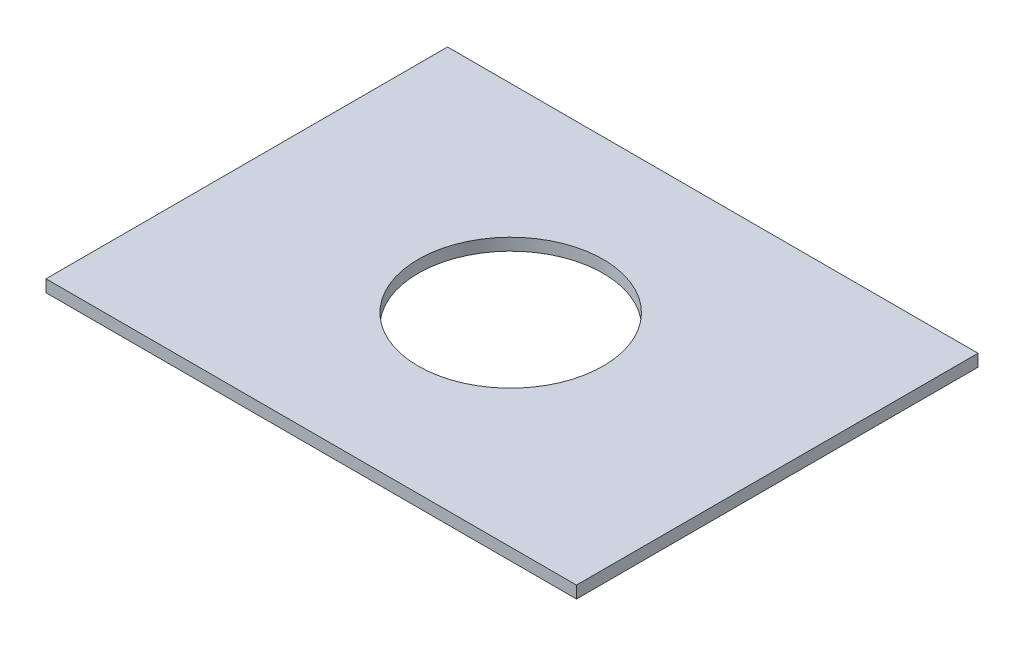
ISO-10303-21;
HEADER;
FILE_DESCRIPTION(('STEP AP214'),'2;1');
FILE_NAME('part.step','',(''),(''),'','','');
FILE_SCHEMA(('AUTOMOTIVE_DESIGN { 1 0 10303 214 1 1 1 1 }'));
ENDSEC;
DATA;
#1=APPLICATION_CONTEXT('core data for automotive mechanical design processes');
#2=APPLICATION_PROTOCOL_DEFINITION('international standard','automotive_design',2000,#1);
#3=PRODUCT_CONTEXT('',#1,'mechanical');
#4=PRODUCT('Part','Part','',(#3));
#5=PRODUCT_RELATED_PRODUCT_CATEGORY('part','',(#4));
#6=PRODUCT_DEFINITION_FORMATION('','',#4);
#7=PRODUCT_DEFINITION_CONTEXT('part definition',#1,'design');
#8=PRODUCT_DEFINITION('design','',#6,#7);
#9=PRODUCT_DEFINITION_SHAPE('','',#8);
#10=(LENGTH_UNIT() NAMED_UNIT(*) SI_UNIT(.MILLI.,.METRE.));
#11=(NAMED_UNIT(*) PLANE_ANGLE_UNIT() SI_UNIT($,.RADIAN.));
#12=(NAMED_UNIT(*) SI_UNIT($,.STERADIAN.) SOLID_ANGLE_UNIT());
#13=UNCERTAINTY_MEASURE_WITH_UNIT(LENGTH_MEASURE(1.E-05),#10,'distance_accuracy_value','');
#14=(GEOMETRIC_REPRESENTATION_CONTEXT(3) GLOBAL_UNCERTAINTY_ASSIGNED_CONTEXT((#13)) GLOBAL_UNIT_ASSIGNED_CONTEXT((#10,
#11,#12)) REPRESENTATION_CONTEXT('',''));
#15=CARTESIAN_POINT('',(0.,0.,0.));
#16=DIRECTION('',(0.,0.,1.));
#17=DIRECTION('',(1.,0.,0.));
#18=AXIS2_PLACEMENT_3D('',#15,#16,#17);
#19=CARTESIAN_POINT('',(0.,2.54,0.));
#20=DIRECTION('',(1.,0.,0.));
#21=DIRECTION('',(0.,0.,-1.));
#22=AXIS2_PLACEMENT_3D('',#19,#20,#21);
#23=PLANE('',#22);
#24=DIRECTION('',(0.,0.,1.));
#25=VECTOR('',#24,1.);
#26=CARTESIAN_POINT('',(0.,0.,0.));
#27=LINE('',#26,#25);
#28=CARTESIAN_POINT('',(0.,0.,-84.2861057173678));
#29=VERTEX_POINT('',#28);
#30=CARTESIAN_POINT('',(0.,0.,0.));
#31=VERTEX_POINT('',#30);
#32=EDGE_CURVE('E80',#29,#31,#27,.T.);
#33=ORIENTED_EDGE('',*,*,#32,.T.);
#34=DIRECTION('',(0.,-1.,0.));
#35=VECTOR('',#34,1.);
#36=CARTESIAN_POINT('',(0.,2.54,0.));
#37=LINE('',#36,#35);
#38=CARTESIAN_POINT('',(0.,2.54,0.));
#39=VERTEX_POINT('',#38);
#40=EDGE_CURVE('E11',#39,#31,#37,.T.);
#41=ORIENTED_EDGE('',*,*,#40,.F.);
#42=DIRECTION('',(0.,0.,1.));
#43=VECTOR('',#42,1.);
#44=CARTESIAN_POINT('',(0.,2.54,0.));
#45=LINE('',#44,#43);
#46=CARTESIAN_POINT('',(0.,2.54,-84.2861057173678));
#47=VERTEX_POINT('',#46);
#48=EDGE_CURVE('E103',#47,#39,#45,.T.);
#49=ORIENTED_EDGE('',*,*,#48,.F.);
#50=DIRECTION('',(0.,-1.,0.));
#51=VECTOR('',#50,1.);
#52=CARTESIAN_POINT('',(0.,2.54,-84.2861057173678));
#53=LINE('',#52,#51);
#54=EDGE_CURVE('E92',#47,#29,#53,.T.);
#55=ORIENTED_EDGE('',*,*,#54,.T.);
#56=EDGE_LOOP('',(#33,#41,#49,#55));
#57=FACE_BOUND('',#56,.T.);
#58=ADVANCED_FACE('F36',(#57),#23,.F.);
#59=CARTESIAN_POINT('',(0.,2.54,0.));
#60=DIRECTION('',(0.,0.,-1.));
#61=DIRECTION('',(-1.,0.,0.));
#62=AXIS2_PLACEMENT_3D('',#59,#60,#61);
#63=PLANE('',#62);
#64=DIRECTION('',(1.,0.,0.));
#65=VECTOR('',#64,1.);
#66=CARTESIAN_POINT('',(0.,0.,0.));
#67=LINE('',#66,#65);
#68=CARTESIAN_POINT('',(111.357497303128,0.,0.));
#69=VERTEX_POINT('',#68);
#70=EDGE_CURVE('E76',#31,#69,#67,.T.);
#71=ORIENTED_EDGE('',*,*,#70,.T.);
#72=DIRECTION('',(0.,-1.,0.));
#73=VECTOR('',#72,1.);
#74=CARTESIAN_POINT('',(111.357497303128,2.54,0.));
#75=LINE('',#74,#73);
#76=CARTESIAN_POINT('',(111.357497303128,2.54,0.));
#77=VERTEX_POINT('',#76);
#78=EDGE_CURVE('E43',#77,#69,#75,.T.);
#79=ORIENTED_EDGE('',*,*,#78,.F.);
#80=DIRECTION('',(1.,0.,0.));
#81=VECTOR('',#80,1.);
#82=CARTESIAN_POINT('',(0.,2.54,0.));
#83=LINE('',#82,#81);
#84=EDGE_CURVE('E88',#39,#77,#83,.T.);
#85=ORIENTED_EDGE('',*,*,#84,.F.);
#86=ORIENTED_EDGE('',*,*,#40,.T.);
#87=EDGE_LOOP('',(#71,#79,#85,#86));
#88=FACE_BOUND('',#87,.T.);
#89=ADVANCED_FACE('F87',(#88),#63,.F.);
#90=CARTESIAN_POINT('',(111.357497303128,2.54,0.));
#91=DIRECTION('',(-1.,0.,0.));
#92=DIRECTION('',(0.,0.,1.));
#93=AXIS2_PLACEMENT_3D('',#90,#91,#92);
#94=PLANE('',#93);
#95=DIRECTION('',(0.,0.,-1.));
#96=VECTOR('',#95,1.);
#97=CARTESIAN_POINT('',(111.357497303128,0.,0.));
#98=LINE('',#97,#96);
#99=CARTESIAN_POINT('',(111.357497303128,0.,-84.2861057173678));
#100=VERTEX_POINT('',#99);
#101=EDGE_CURVE('E81',#69,#100,#98,.T.);
#102=ORIENTED_EDGE('',*,*,#101,.T.);
#103=DIRECTION('',(0.,-1.,0.));
#104=VECTOR('',#103,1.);
#105=CARTESIAN_POINT('',(111.357497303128,2.54,-84.2861057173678));
#106=LINE('',#105,#104);
#107=CARTESIAN_POINT('',(111.357497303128,2.54,-84.2861057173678));
#108=VERTEX_POINT('',#107);
#109=EDGE_CURVE('E109',#108,#100,#106,.T.);
#110=ORIENTED_EDGE('',*,*,#109,.F.);
#111=DIRECTION('',(0.,0.,-1.));
#112=VECTOR('',#111,1.);
#113=CARTESIAN_POINT('',(111.357497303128,2.54,0.));
#114=LINE('',#113,#112);
#115=EDGE_CURVE('E55',#77,#108,#114,.T.);
#116=ORIENTED_EDGE('',*,*,#115,.F.);
#117=ORIENTED_EDGE('',*,*,#78,.T.);
#118=EDGE_LOOP('',(#102,#110,#116,#117));
#119=FACE_BOUND('',#118,.T.);
#120=ADVANCED_FACE('F112',(#119),#94,.F.);
#121=CARTESIAN_POINT('',(0.,2.54,-84.2861057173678));
#122=DIRECTION('',(0.,0.,1.));
#123=DIRECTION('',(1.,0.,0.));
#124=AXIS2_PLACEMENT_3D('',#121,#122,#123);
#125=PLANE('',#124);
#126=DIRECTION('',(-1.,0.,0.));
#127=VECTOR('',#126,1.);
#128=CARTESIAN_POINT('',(0.,0.,-84.2861057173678));
#129=LINE('',#128,#127);
#130=EDGE_CURVE('E101',#100,#29,#129,.T.);
#131=ORIENTED_EDGE('',*,*,#130,.T.);
#132=ORIENTED_EDGE('',*,*,#54,.F.);
#133=DIRECTION('',(-1.,0.,0.));
#134=VECTOR('',#133,1.);
#135=CARTESIAN_POINT('',(0.,2.54,-84.2861057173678));
#136=LINE('',#135,#134);
#137=EDGE_CURVE('E50',#108,#47,#136,.T.);
#138=ORIENTED_EDGE('',*,*,#137,.F.);
#139=ORIENTED_EDGE('',*,*,#109,.T.);
#140=EDGE_LOOP('',(#131,#132,#138,#139));
#141=FACE_BOUND('',#140,.T.);
#142=ADVANCED_FACE('F114',(#141),#125,.F.);
#143=CARTESIAN_POINT('',(0.,2.54,-84.2861057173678));
#144=DIRECTION('',(0.,-1.,0.));
#145=DIRECTION('',(0.,0.,-1.));
#146=AXIS2_PLACEMENT_3D('',#143,#144,#145);
#147=PLANE('',#146);
#148=CARTESIAN_POINT('',(54.9361469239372,2.54,-42.6071789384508));
#149=DIRECTION('',(0.,1.,0.));
#150=DIRECTION('',(0.,0.,1.));
#151=AXIS2_PLACEMENT_3D('',#148,#149,#150);
#152=CIRCLE('',#151,19.4132473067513);
#153=CARTESIAN_POINT('',(54.9361469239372,2.54,-23.1939316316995));
#154=VERTEX_POINT('',#153);
#155=EDGE_CURVE('E96',#154,#154,#152,.T.);
#156=ORIENTED_EDGE('',*,*,#155,.F.);
#157=EDGE_LOOP('',(#156));
#158=FACE_BOUND('',#157,.T.);
#159=ORIENTED_EDGE('',*,*,#48,.T.);
#160=ORIENTED_EDGE('',*,*,#84,.T.);
#161=ORIENTED_EDGE('',*,*,#115,.T.);
#162=ORIENTED_EDGE('',*,*,#137,.T.);
#163=EDGE_LOOP('',(#159,#160,#161,#162));
#164=FACE_BOUND('',#163,.T.);
#165=ADVANCED_FACE('F115',(#158,#164),#147,.F.);
#166=CARTESIAN_POINT('',(0.,0.,-84.2861057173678));
#167=DIRECTION('',(0.,-1.,0.));
#168=DIRECTION('',(0.,0.,-1.));
#169=AXIS2_PLACEMENT_3D('',#166,#167,#168);
#170=PLANE('',#169);
#171=CARTESIAN_POINT('',(54.9361469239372,0.,-42.6071789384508));
#172=DIRECTION('',(0.,1.,0.));
#173=DIRECTION('',(0.,0.,1.));
#174=AXIS2_PLACEMENT_3D('',#171,#172,#173);
#175=CIRCLE('',#174,19.4132473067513);
#176=CARTESIAN_POINT('',(54.9361469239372,0.,-23.1939316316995));
#177=VERTEX_POINT('',#176);
#178=EDGE_CURVE('E93',#177,#177,#175,.T.);
#179=ORIENTED_EDGE('',*,*,#178,.T.);
#180=EDGE_LOOP('',(#179));
#181=FACE_BOUND('',#180,.T.);
#182=ORIENTED_EDGE('',*,*,#32,.F.);
#183=ORIENTED_EDGE('',*,*,#130,.F.);
#184=ORIENTED_EDGE('',*,*,#101,.F.);
#185=ORIENTED_EDGE('',*,*,#70,.F.);
#186=EDGE_LOOP('',(#182,#183,#184,#185));
#187=FACE_BOUND('',#186,.T.);
#188=ADVANCED_FACE('F77',(#181,#187),#170,.T.);
#189=CARTESIAN_POINT('',(54.9361469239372,0.,-42.6071789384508));
#190=DIRECTION('',(0.,1.,0.));
#191=DIRECTION('',(0.,0.,1.));
#192=AXIS2_PLACEMENT_3D('',#189,#190,#191);
#193=CYLINDRICAL_SURFACE('',#192,19.4132473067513);
#194=ORIENTED_EDGE('',*,*,#178,.F.);
#195=EDGE_LOOP('',(#194));
#196=FACE_BOUND('',#195,.T.);
#197=ORIENTED_EDGE('',*,*,#155,.T.);
#198=EDGE_LOOP('',(#197));
#199=FACE_BOUND('',#198,.T.);
#200=ADVANCED_FACE('F123',(#196,#199),#193,.F.);
#201=CLOSED_SHELL('',(#58,#89,#120,#142,#165,#188,#200));
#202=MANIFOLD_SOLID_BREP('B2',#201);
#203=ADVANCED_BREP_SHAPE_REPRESENTATION('',(#18,#202),#14);
#204=SHAPE_DEFINITION_REPRESENTATION(#9,#203);
ENDSEC;
END-ISO-10303-21;
